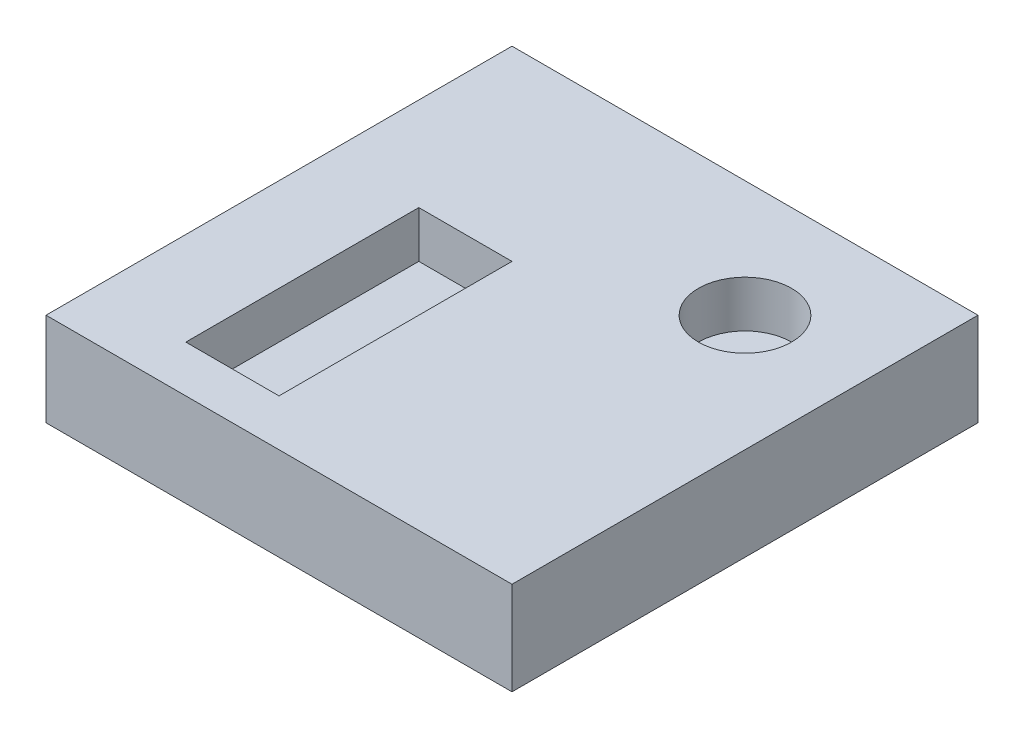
from build123d import *

# Parameters (mm, degrees)
SKIZZE1_W                       = 100
SKIZZE1_H                       = 100
AUFSATZ_LINEAR_AUSTRAGEN1_DEPTH = 20
SKIZZE2_W                       = 20
SKIZZE2_H                       = 50
SCHNITT_LINEAR_AUSTRAGEN1_DEPTH = 10
SKIZZE3_R                       = 10
SCHNITT_LINEAR_AUSTRAGEN2_DEPTH = 10


with BuildPart() as part:
    # Skizze1 → Aufsatz-Linear austragen1 (new body)
    with BuildSketch(Plane(origin=(0, 0, 0), x_dir=(1, 0, 0), z_dir=(0, 1, 0))):
        with Locations((-50, 50)):
            Rectangle(SKIZZE1_W, SKIZZE1_H)
    extrude(amount=AUFSATZ_LINEAR_AUSTRAGEN1_DEPTH)

    # Skizze2 → Schnitt-Linear austragen1 (cut)
    with BuildSketch(Plane(origin=(0, 20, 0), x_dir=(1, 0, 0), z_dir=(0, 1, 0))):
        with Locations((-70, 35)):
            Rectangle(SKIZZE2_W, SKIZZE2_H)
    extrude(amount=-SCHNITT_LINEAR_AUSTRAGEN1_DEPTH, mode=Mode.SUBTRACT)

    # Skizze3 → Schnitt-Linear austragen2 (cut)
    with BuildSketch(Plane(origin=(0, 20, 0), x_dir=(1, 0, 0), z_dir=(0, 1, 0))):
        with Locations(Location((-25, 75, 0), (0, 0, 270))):
            Circle(SKIZZE3_R)
    extrude(amount=-SCHNITT_LINEAR_AUSTRAGEN2_DEPTH, mode=Mode.SUBTRACT)


solid = part.part
